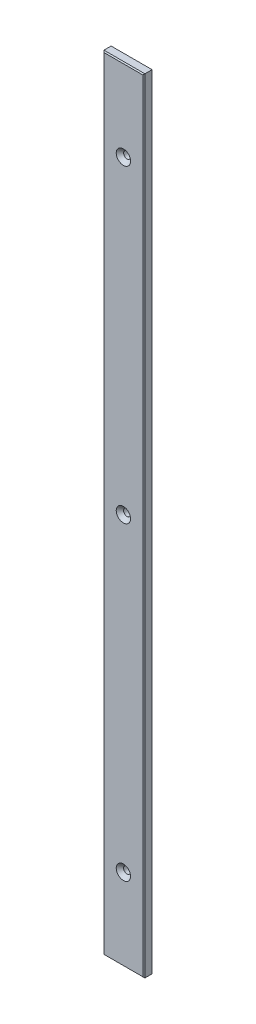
from build123d import *

# Parameters (mm, degrees)
SKIZZE1_W                                            = 20
SKIZZE1_H                                            = 382.5
AUFSATZ_LINEAR_AUSTRAGEN1_DEPTH                      = 4
FORMSENKUNG_F_R_M3_SENKSCHRAUBE_MIT_INNE_D           = 3.4
FORMSENKUNG_F_R_M3_SENKSCHRAUBE_MIT_INNE_CSINK_D     = 7
FORMSENKUNG_F_R_M3_SENKSCHRAUBE_MIT_INNE_CSINK_ANGLE = 90
FASE1_SIZE                                           = 0.5


with BuildPart() as part:
    # Skizze1 → Aufsatz-Linear austragen1 (new body)
    with BuildSketch(Plane.XY):
        Rectangle(SKIZZE1_W, SKIZZE1_H)
    extrude(amount=AUFSATZ_LINEAR_AUSTRAGEN1_DEPTH)

    # Formsenkung f_r M3 Senkschraube mit Inne (through all)
    with Locations(Plane.XY.offset(4)):
        with Locations((0, 151.25), (0, 0), (0, -151.25)):
            CounterSinkHole(FORMSENKUNG_F_R_M3_SENKSCHRAUBE_MIT_INNE_D / 2, FORMSENKUNG_F_R_M3_SENKSCHRAUBE_MIT_INNE_CSINK_D / 2, counter_sink_angle=FORMSENKUNG_F_R_M3_SENKSCHRAUBE_MIT_INNE_CSINK_ANGLE)

    # Fase1
    fase1_edges = [part.edges().sort_by_distance(p)[0] for p in [
        (-10, 0, 4),
        (0, -191.25, 4),
        (10, 0, 4),
        (0, 191.25, 4),
    ]]
    chamfer(fase1_edges, length=FASE1_SIZE)


solid = part.part
